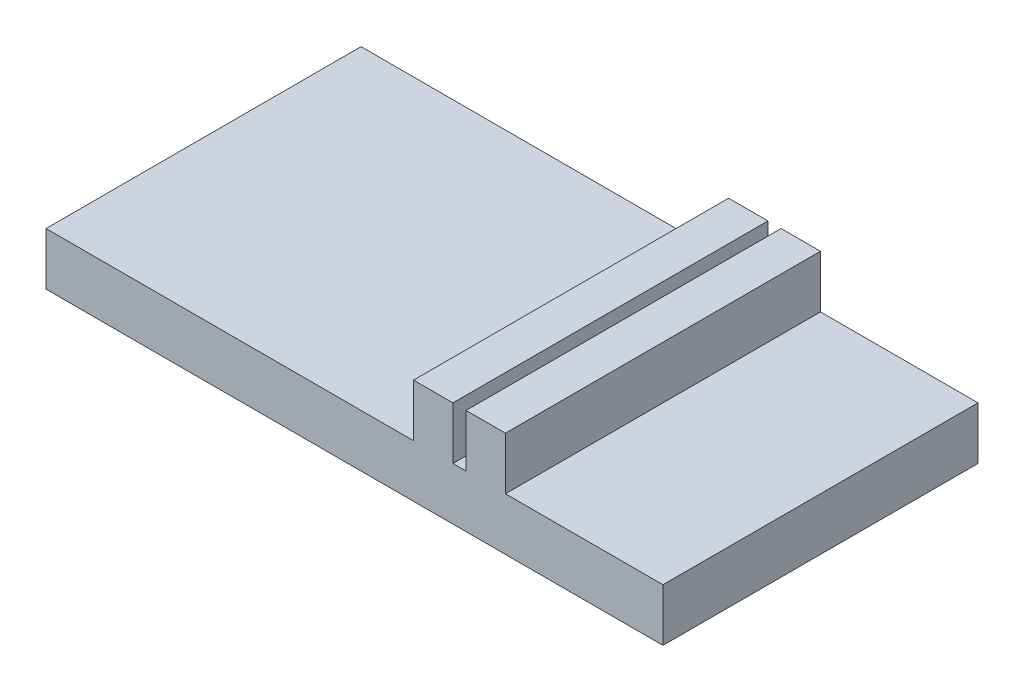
from build123d import *

# Parameters (mm, degrees)
BOSS_EXTRUDE1_DEPTH = 152.4


with BuildPart() as part:
    # Sketch1 → Boss-Extrude1 (new body)
    with BuildSketch(Plane.XY):
        Polygon((0, 0), (298.45, 0), (298.45, 25.4), (222.25, 25.4), (222.25, 50.8), (203.2, 50.8), (203.2, 25.4), (196.85, 25.4), (196.85, 50.8), (177.8, 50.8), (177.8, 25.4), (0, 25.4), align=None)
    extrude(amount=BOSS_EXTRUDE1_DEPTH)


solid = part.part
